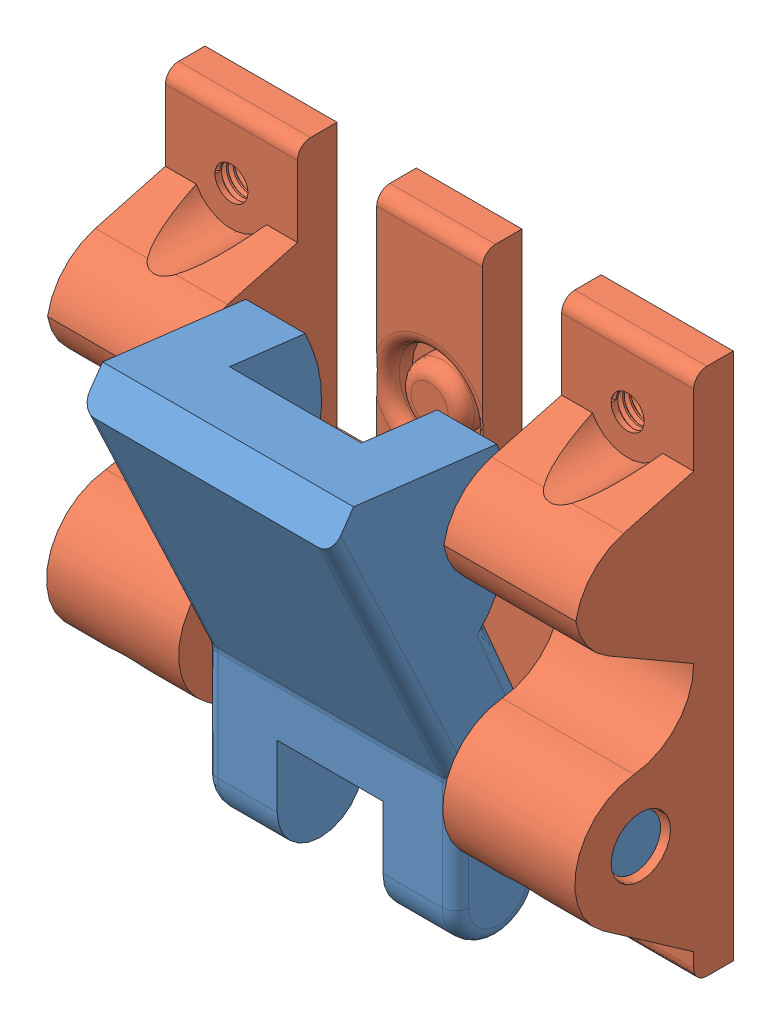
SolidWorks assembly Pannier Clip Assembly.SLDASM, configuration Default (file format 15000). Lengths in mm.
Overall size (40 40.65 23.87).
2 component instances, 2 part files, 6 mates.
Components (placement in the parent):
- pannier clip hinge-1: pannier clip hinge.SLDPRT [Default] at (-20 11.0053 7) x (0 -0.991763 0.128089) z (-1 0 0) size (32.35 19.41 39)
- pannier clip base-1: pannier clip base.SLDPRT [Default] at (-20 0 0) x (-1 0 0) z (0 0 -1) size (40 40 12.17)
Mates (geometry in assembly coordinates):
- Concentric1: concentric aligned: cylinder of pannier clip hinge-1 through (-39.5 11.0053 7) axis (1 0 0) radius 2; cylinder of pannier clip base-1 through (-40 11.0053 7) axis (1 0 0) radius 2.25
- Coincident1: coincident anti-aligned: plane of pannier clip base-1 through (-40 16.0053 0) normal (0 0 -1)
- Coincident2: coincident aligned: plane of pannier clip base-1 through (0 11.0053 7) normal (1 0 0)
- Distance1: distance = 0.5 mm anti-aligned: plane of pannier clip hinge-1 through (-10.5 3.0053 7.2662) normal (1 0 0); plane of pannier clip base-1 through (-10 40 3) normal (-1 0 0)
- Coincident3: coincident anti-aligned: plane of pannier clip base-1 through (-40 0 0) normal (0 -1 0)
- Parallel1: parallel anti-aligned: plane of pannier clip hinge-1 through (-29.5 11.0053 4) normal (0 0 -1); plane of pannier clip base-1 through (-40 40 3) normal (0 0 1)
